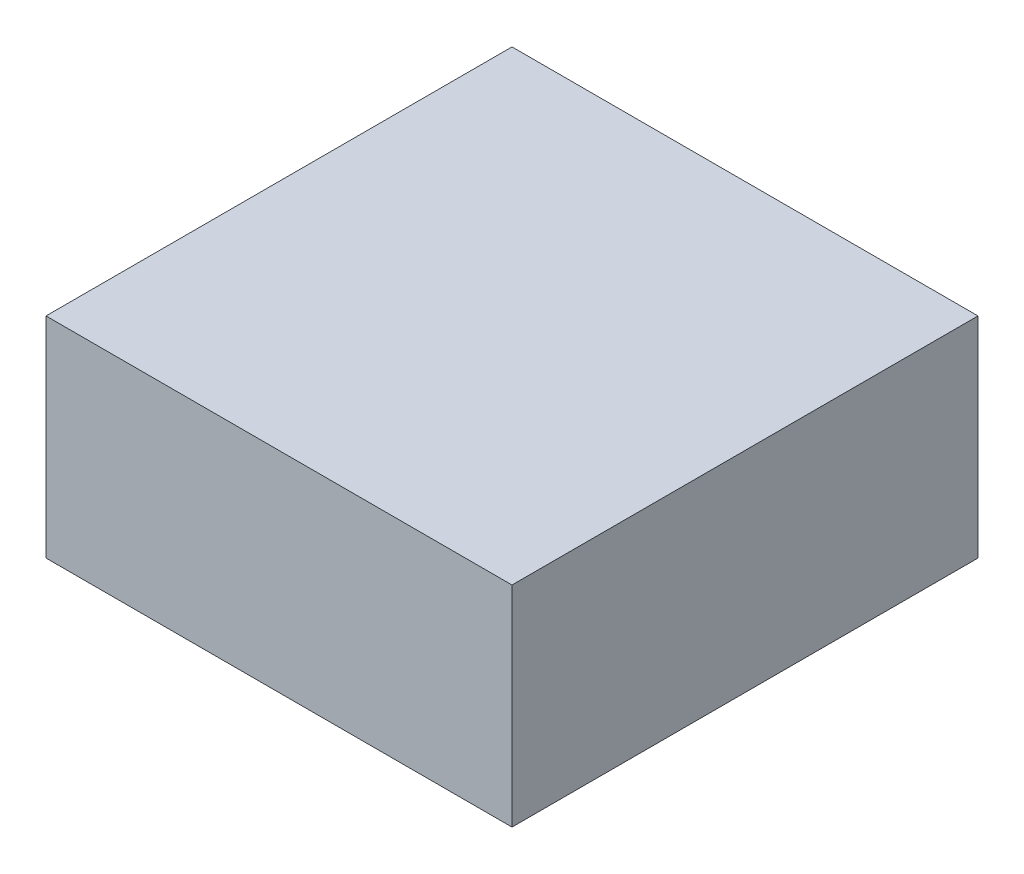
from build123d import *

# Parameters (mm, degrees)
ESQUISSE1_W             = 100
ESQUISSE1_H             = 45
EXTRUSION1_DEPTH        = 100
ESQUISSE2_R             = 22
ENL_V_MAT_EXTRU_1_DEPTH = 17
ENL_V_MAT_EXTRU_1_DRAFT = -12


with BuildPart() as part:
    # Esquisse1 → Extrusion1 (new body)
    with BuildSketch(Plane.XY):
        with Locations((0, 2.5)):
            Rectangle(ESQUISSE1_W, ESQUISSE1_H)
    extrude(amount=EXTRUSION1_DEPTH)


with BuildPart() as enl_v_mat_extru_1_tool:
    # Esquisse2 → Enl_v. mat.-Extru.1 (with draft: the straight prism first)
    with BuildSketch(Plane.XZ.offset(20)):
        with Locations((0, 50)):
            Circle(ESQUISSE2_R)
    extrude(amount=-ENL_V_MAT_EXTRU_1_DEPTH)
    # Enl_v. mat.-Extru.1: the draft: its side faces are tilted about the plane it starts from
    enl_v_mat_extru_1_sides = [enl_v_mat_extru_1_tool.faces().sort_by_distance(p)[0] for p in [
        (-22, -11.5, 50),
    ]]
    draft(enl_v_mat_extru_1_sides, Plane.XZ.offset(20), ENL_V_MAT_EXTRU_1_DRAFT)


with BuildPart() as part_1:
    add(part.part)

    # Enl_v. mat.-Extru.1: cut by enl_v_mat_extru_1_tool
    add(enl_v_mat_extru_1_tool.part, mode=Mode.SUBTRACT)


solid = part_1.part
